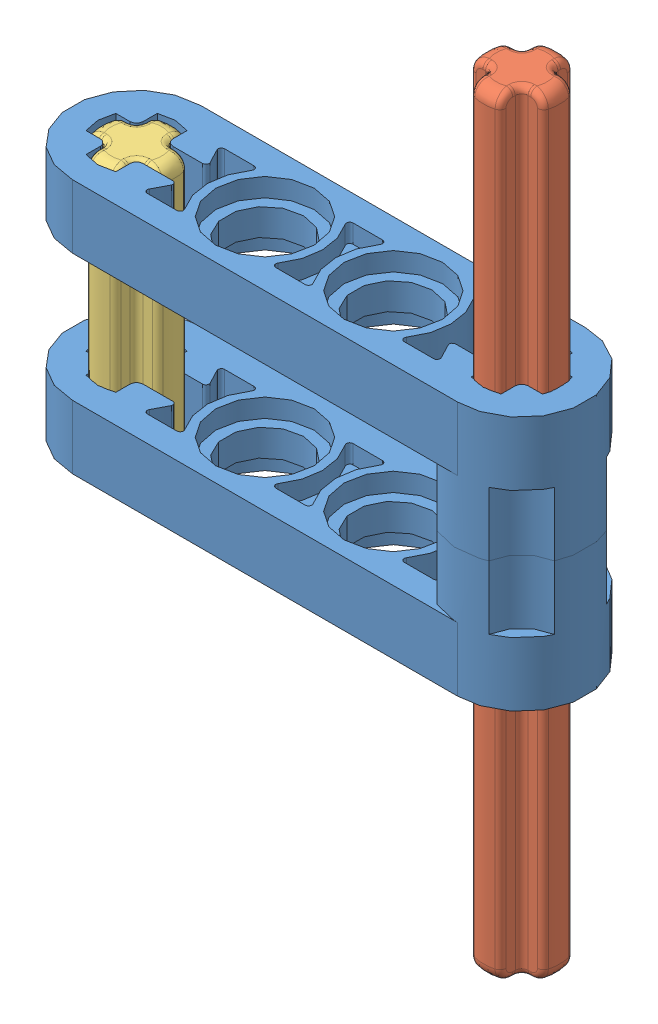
SolidWorks assembly rollbar2.SLDASM, configuration Default (file format 4400). Lengths in mm.
Overall size (31.75 47.72 7.94).
4 component instances, 3 part files, 12 mates.
Components (placement in the parent):
- 4 rollbar-1: 4 rollbar.SLDPRT [Default] at (0 5.9055 0) size (31.75 7.87 7.94)
- 4 rollbar-2: 4 rollbar.SLDPRT [Default] at (0 -5.9055 0) x (1 0 0) z (0 0 -1) size (31.75 7.87 7.94)
- 6 axle-2: 6 axle.SLDPRT [Default] at (11.9062 0 0) x (0 -1 0) z (0 0 -1) size (47.72 4.72 4.72)
- 2 axle-1: 2 axle.SLDPRT [Default] at (-11.9062 0 0) x (0 -1 0) z (0 0 -1) size (15.97 4.72 4.72)
Mates (geometry in assembly coordinates):
- Coincident1: coincident aligned: plane of 4 rollbar-1; plane of assembly
- Coincident3: coincident aligned: plane of 4 rollbar-1; plane of assembly
- Coincident4: coincident anti-aligned: plane of 4 rollbar-1 through (11.9062 0 0) normal (0 -1 0); plane of assembly
- Coincident5: coincident anti-aligned: plane of 4 rollbar-1 through (11.9062 0 0) normal (0 -1 0); plane of 4 rollbar-2 through (11.9062 0 0) normal (0 1 0)
- Concentric1: concentric anti-aligned: cylinder of 4 rollbar-1 through (11.9062 7.874 0) axis (0 -1 0) radius 3.9688; cylinder of 4 rollbar-2 through (11.9062 -7.874 0) axis (0 1 0) radius 3.9688
- Concentric2: concentric anti-aligned: cylinder of 4 rollbar-1 through (-11.9062 7.874 0) axis (0 -1 0) radius 3.9688; cylinder of 4 rollbar-2 through (-11.9062 -7.874 0) axis (0 1 0) radius 3.9688
- Concentric3: concentric anti-aligned: cylinder of 4 rollbar-2 through (11.9062 -3.937 0) axis (0 -1 0) radius 2.3876; cylinder of 6 axle-2 through (11.9062 -7.874 0) axis (0 1 0) radius 2.3622
- Parallel1: parallel anti-aligned: plane of 4 rollbar-2 through (12.827 -3.937 2.2029) normal (-1 0 0); plane of 6 axle-2 through (12.827 23.8589 -0.9208) normal (1 0 0)
- Coincident8: coincident anti-aligned: plane of assembly through (11.9062 0 0) normal (0 1 0)
- Concentric4: concentric anti-aligned: cylinder of 4 rollbar-2 through (-11.9062 -3.937 0) axis (0 -1 0) radius 2.3876; cylinder of 2 axle-1 through (-11.9062 -7.9375 0) axis (0 1 0) radius 2.3622
- Parallel2: parallel anti-aligned: plane of 4 rollbar-2 through (-12.827 -3.937 0.9208) normal (0 0 -1); plane of 2 axle-1 through (-14.0816 7.9375 0.9208) normal (0 0 1)
- Coincident9: coincident anti-aligned: plane of assembly through (11.9062 0 0) normal (0 1 0)
